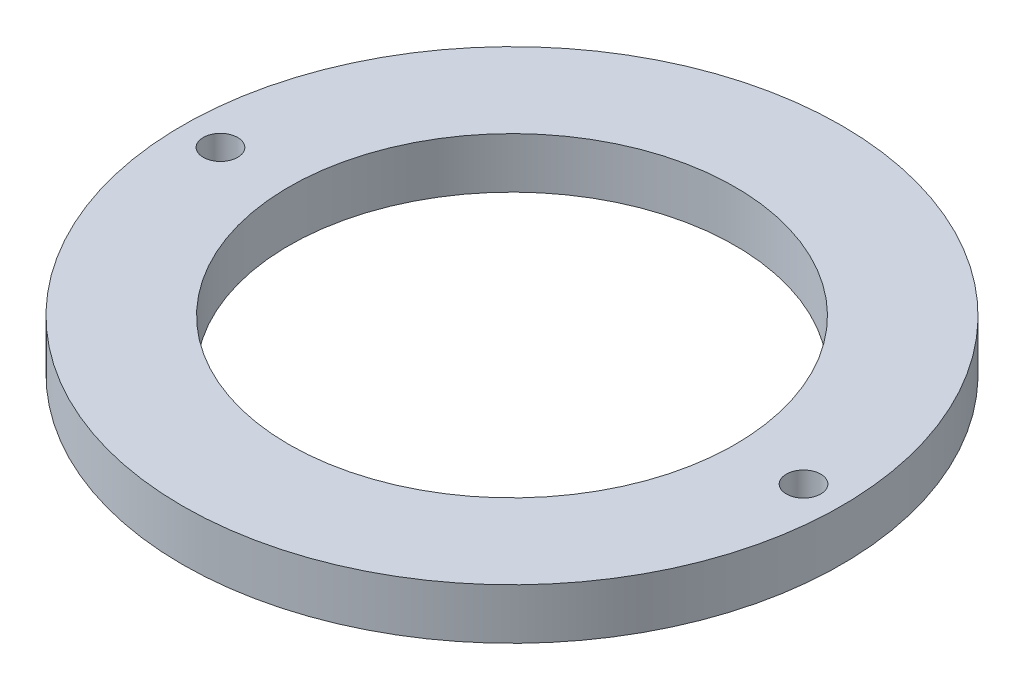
from build123d import *

# Parameters (mm, degrees)
ESQUISSE1_R      = 65
ESQUISSE1_R_2    = 44
ESQUISSE1_R_3    = 3.4
EXTRUSION1_DEPTH = 10


with BuildPart() as part:
    # Esquisse1 → Extrusion1 (new body)
    with BuildSketch(Plane(origin=(0, 0, 0), x_dir=(1, 0, 0), z_dir=(0, 1, 0))):
        with Locations(Location((0, 0, 0), (0, 0, 270))):
            Circle(ESQUISSE1_R)
        with Locations(Location((0, 0, 0), (0, 0, 270))):
            Circle(ESQUISSE1_R_2, mode=Mode.SUBTRACT)
        with Locations(Location((57.5, 0, 0), (0, 0, 270))):
            Circle(ESQUISSE1_R_3, mode=Mode.SUBTRACT)
        with Locations(Location((-57.5, 0, 0), (0, 0, 270))):
            Circle(ESQUISSE1_R_3, mode=Mode.SUBTRACT)
    extrude(amount=EXTRUSION1_DEPTH)


solid = part.part
